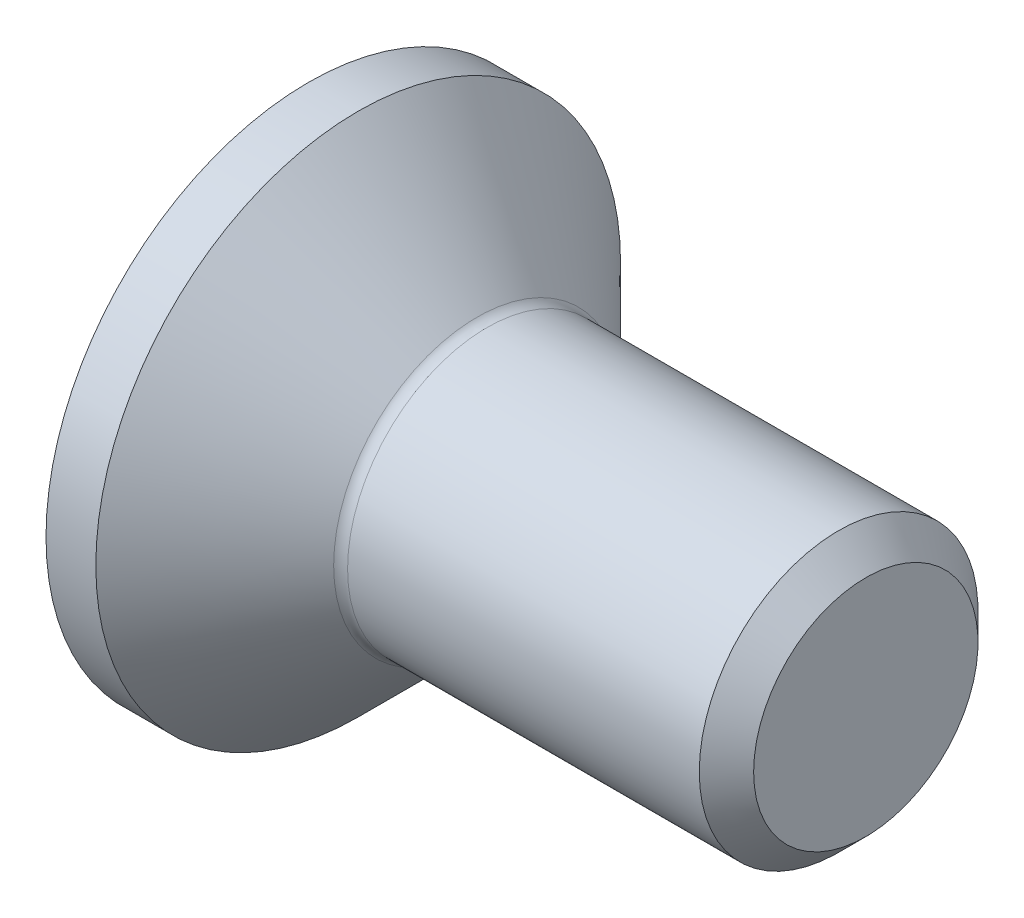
from build123d import *

# Parameters (mm, degrees)
FILLET1_R   = 0.2
HEX_2_DEPTH = 1.5


with BuildPart() as part:
    # BodySke → BaseBody (revolve)
    with BuildSketch(Plane.XY, mode=Mode.PRIVATE) as basebody_sk:
        Polygon((0, 0), (0, 3.765), (0.715, 3.765), (2.48, 2), (7.61, 2), (8, 1.61), (8, 0), align=None)
    revolve(basebody_sk.sketch.rotate(Axis((0, 0, 0), (1, 0, 0)), 90), axis=Axis((0, 0, 0), (1, 0, 0)))

    # Fillet1
    fillet1_edges = [part.edges().sort_by_distance(p)[0] for p in [
        (2.48, 0, -2),
    ]]
    fillet(fillet1_edges, radius=FILLET1_R)

    # Sketch2 → PreBroach (revolve, cut)
    with BuildSketch(Plane.XY, mode=Mode.PRIVATE) as prebroach_sk:
        Polygon((0, 1.25), (1.5, 1.25), (2.221687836, 0), (0, 0), align=None)
    revolve(prebroach_sk.sketch.rotate(Axis((0, 0, 0), (1, 0, 0)), 90), axis=Axis((0, 0, 0), (1, 0, 0)), mode=Mode.SUBTRACT)

    # Sketch3 → Hex 2 (cut)
    with BuildSketch(Plane.ZY):
        Polygon((-1.25, -0.721687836), (-1.25, 0.721687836), (0, 1.443375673), (1.25, 0.721687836), (1.25, -0.721687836), (0, -1.443375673), align=None)
    extrude(amount=-HEX_2_DEPTH, mode=Mode.SUBTRACT)


solid = part.part
